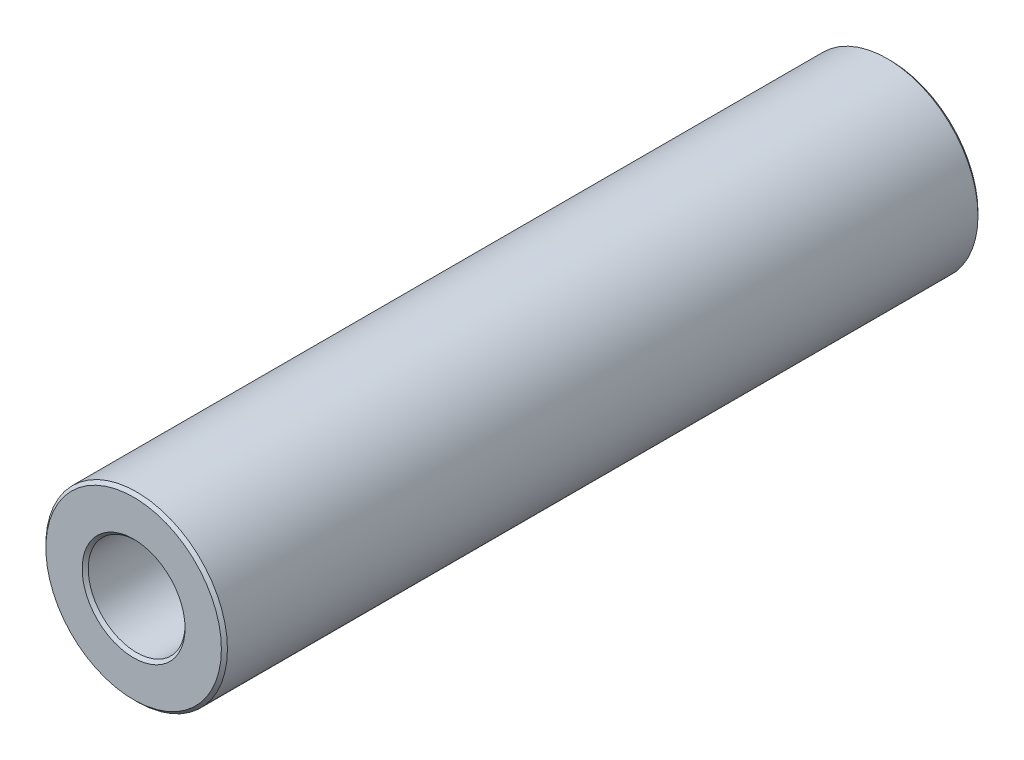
from build123d import *

# Parameters (mm, degrees)
SKETCH1_R           = 3
SKETCH1_R_2         = 1.6
BOSS_EXTRUDE2_DEPTH = 12.5
CHAMFER3_SIZE       = 0.1


with BuildPart() as part:
    # Sketch1 → Boss-Extrude2 (new, symmetric)
    with BuildSketch(Plane.XY):
        Circle(SKETCH1_R)
        Circle(SKETCH1_R_2, mode=Mode.SUBTRACT)
    extrude(amount=BOSS_EXTRUDE2_DEPTH, both=True)

    # Chamfer3
    chamfer3_edges = [part.edges().sort_by_distance(p)[0] for p in [
        (-3, 0, -12.5),
        (-3, 0, 12.5),
        (-1.6, 0, -12.5),
        (-1.6, 0, 12.5),
    ]]
    chamfer(chamfer3_edges, length=CHAMFER3_SIZE)


solid = part.part
